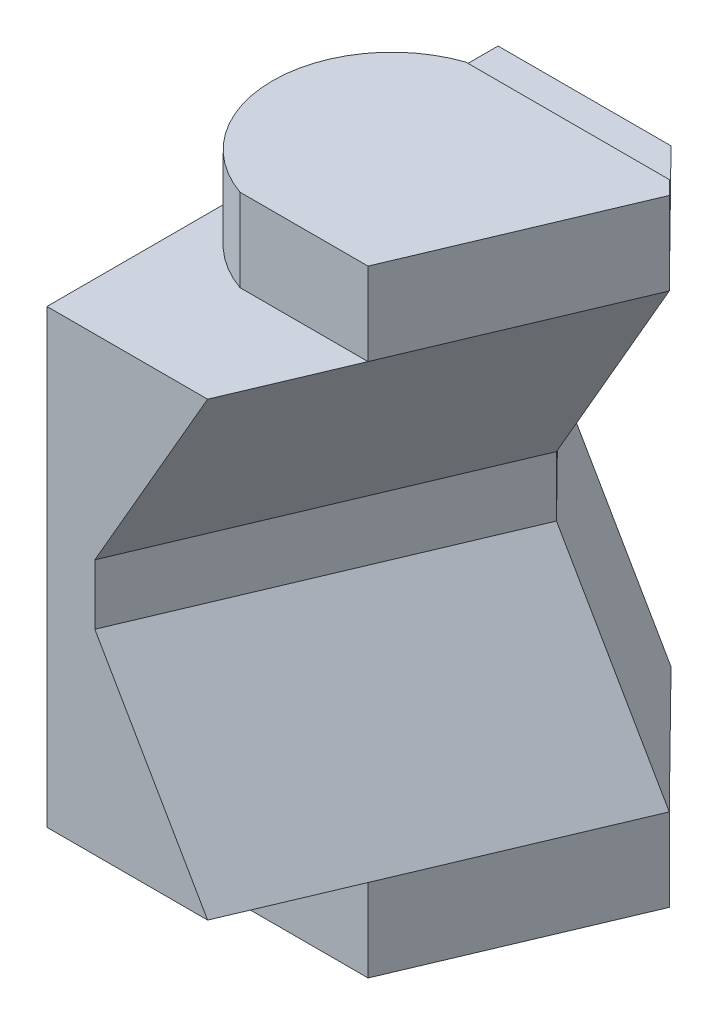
ISO-10303-21;
HEADER;
FILE_DESCRIPTION(('STEP AP214'),'2;1');
FILE_NAME('part.step','',(''),(''),'','','');
FILE_SCHEMA(('AUTOMOTIVE_DESIGN { 1 0 10303 214 1 1 1 1 }'));
ENDSEC;
DATA;
#1=APPLICATION_CONTEXT('core data for automotive mechanical design processes');
#2=APPLICATION_PROTOCOL_DEFINITION('international standard','automotive_design',2000,#1);
#3=PRODUCT_CONTEXT('',#1,'mechanical');
#4=PRODUCT('Part','Part','',(#3));
#5=PRODUCT_RELATED_PRODUCT_CATEGORY('part','',(#4));
#6=PRODUCT_DEFINITION_FORMATION('','',#4);
#7=PRODUCT_DEFINITION_CONTEXT('part definition',#1,'design');
#8=PRODUCT_DEFINITION('design','',#6,#7);
#9=PRODUCT_DEFINITION_SHAPE('','',#8);
#10=(LENGTH_UNIT() NAMED_UNIT(*) SI_UNIT(.MILLI.,.METRE.));
#11=(NAMED_UNIT(*) PLANE_ANGLE_UNIT() SI_UNIT($,.RADIAN.));
#12=(NAMED_UNIT(*) SI_UNIT($,.STERADIAN.) SOLID_ANGLE_UNIT());
#13=UNCERTAINTY_MEASURE_WITH_UNIT(LENGTH_MEASURE(1.E-05),#10,'distance_accuracy_value','');
#14=(GEOMETRIC_REPRESENTATION_CONTEXT(3) GLOBAL_UNCERTAINTY_ASSIGNED_CONTEXT((#13)) GLOBAL_UNIT_ASSIGNED_CONTEXT((#10,
#11,#12)) REPRESENTATION_CONTEXT('',''));
#15=CARTESIAN_POINT('',(0.,0.,0.));
#16=DIRECTION('',(0.,0.,1.));
#17=DIRECTION('',(1.,0.,0.));
#18=AXIS2_PLACEMENT_3D('',#15,#16,#17);
#19=CARTESIAN_POINT('',(7.9361055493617,22.,15.));
#20=DIRECTION('',(0.,-1.,0.));
#21=DIRECTION('',(0.,0.,-1.));
#22=AXIS2_PLACEMENT_3D('',#19,#20,#21);
#23=CYLINDRICAL_SURFACE('',#22,7.93610561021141);
#24=CARTESIAN_POINT('',(7.9361055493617,20.5,15.));
#25=DIRECTION('',(0.,1.,0.));
#26=DIRECTION('',(0.,0.,1.));
#27=AXIS2_PLACEMENT_3D('',#24,#25,#26);
#28=CIRCLE('',#27,7.93610561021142);
#29=CARTESIAN_POINT('',(5.34153964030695,20.5,7.5));
#30=VERTEX_POINT('',#29);
#31=CARTESIAN_POINT('',(5.34153964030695,20.5,22.5));
#32=VERTEX_POINT('',#31);
#33=EDGE_CURVE('E140',#30,#32,#28,.T.);
#34=ORIENTED_EDGE('',*,*,#33,.F.);
#35=DIRECTION('',(0.,-1.,0.));
#36=VECTOR('',#35,1.);
#37=CARTESIAN_POINT('',(5.34153964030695,22.,7.5));
#38=LINE('',#37,#36);
#39=CARTESIAN_POINT('',(5.34153964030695,15.,7.5));
#40=VERTEX_POINT('',#39);
#41=EDGE_CURVE('E170',#30,#40,#38,.T.);
#42=ORIENTED_EDGE('',*,*,#41,.T.);
#43=CARTESIAN_POINT('',(7.9361055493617,15.,15.));
#44=DIRECTION('',(0.,1.,0.));
#45=DIRECTION('',(0.,0.,-1.));
#46=AXIS2_PLACEMENT_3D('',#43,#44,#45);
#47=CIRCLE('',#46,7.93610561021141);
#48=CARTESIAN_POINT('',(0.,15.,15.));
#49=VERTEX_POINT('',#48);
#50=EDGE_CURVE('E270',#40,#49,#47,.T.);
#51=ORIENTED_EDGE('',*,*,#50,.T.);
#52=CARTESIAN_POINT('',(5.34153964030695,15.,22.5));
#53=VERTEX_POINT('',#52);
#54=EDGE_CURVE('E23',#49,#53,#47,.T.);
#55=ORIENTED_EDGE('',*,*,#54,.T.);
#56=DIRECTION('',(0.,-1.,0.));
#57=VECTOR('',#56,1.);
#58=CARTESIAN_POINT('',(5.34153964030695,22.,22.5));
#59=LINE('',#58,#57);
#60=EDGE_CURVE('E154',#32,#53,#59,.T.);
#61=ORIENTED_EDGE('',*,*,#60,.F.);
#62=EDGE_LOOP('',(#34,#42,#51,#55,#61));
#63=FACE_BOUND('',#62,.T.);
#64=ADVANCED_FACE('F14',(#63),#23,.T.);
#65=CARTESIAN_POINT('',(5.34153964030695,22.,22.5));
#66=DIRECTION('',(0.,0.,-1.));
#67=DIRECTION('',(1.,0.,0.));
#68=AXIS2_PLACEMENT_3D('',#65,#66,#67);
#69=PLANE('',#68);
#70=DIRECTION('',(1.,0.,0.));
#71=VECTOR('',#70,1.);
#72=CARTESIAN_POINT('',(5.34153964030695,20.5,22.5));
#73=LINE('',#72,#71);
#74=CARTESIAN_POINT('',(13.8512033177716,20.5,22.5));
#75=VERTEX_POINT('',#74);
#76=EDGE_CURVE('E143',#32,#75,#73,.T.);
#77=ORIENTED_EDGE('',*,*,#76,.F.);
#78=ORIENTED_EDGE('',*,*,#60,.T.);
#79=DIRECTION('',(1.,0.,0.));
#80=VECTOR('',#79,1.);
#81=CARTESIAN_POINT('',(5.34153964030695,15.,22.5));
#82=LINE('',#81,#80);
#83=CARTESIAN_POINT('',(13.8512033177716,15.,22.5));
#84=VERTEX_POINT('',#83);
#85=EDGE_CURVE('E266',#53,#84,#82,.T.);
#86=ORIENTED_EDGE('',*,*,#85,.T.);
#87=DIRECTION('',(0.,-1.,0.));
#88=VECTOR('',#87,1.);
#89=CARTESIAN_POINT('',(13.8512033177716,22.,22.5));
#90=LINE('',#89,#88);
#91=EDGE_CURVE('E156',#75,#84,#90,.T.);
#92=ORIENTED_EDGE('',*,*,#91,.F.);
#93=EDGE_LOOP('',(#77,#78,#86,#92));
#94=FACE_BOUND('',#93,.T.);
#95=ADVANCED_FACE('F152',(#94),#69,.F.);
#96=CARTESIAN_POINT('',(19.8001536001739,22.,8.41686228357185));
#97=DIRECTION('',(-0.921185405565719,0.,-0.389123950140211));
#98=DIRECTION('',(0.389123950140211,0.,-0.921185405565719));
#99=AXIS2_PLACEMENT_3D('',#96,#97,#98);
#100=PLANE('',#99);
#101=DIRECTION('',(0.389123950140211,0.,-0.921185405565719));
#102=VECTOR('',#101,1.);
#103=CARTESIAN_POINT('',(13.8512033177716,20.5,22.5));
#104=LINE('',#103,#102);
#105=CARTESIAN_POINT('',(19.8001536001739,20.5,8.41686228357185));
#106=VERTEX_POINT('',#105);
#107=EDGE_CURVE('E157',#75,#106,#104,.T.);
#108=ORIENTED_EDGE('',*,*,#107,.F.);
#109=ORIENTED_EDGE('',*,*,#91,.T.);
#110=DIRECTION('',(0.389123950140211,0.,-0.921185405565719));
#111=VECTOR('',#110,1.);
#112=CARTESIAN_POINT('',(10.6830792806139,15.,30.));
#113=LINE('',#112,#111);
#114=CARTESIAN_POINT('',(19.8001536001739,15.,8.41686228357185));
#115=VERTEX_POINT('',#114);
#116=EDGE_CURVE('E262',#115,#84,#113,.F.);
#117=ORIENTED_EDGE('',*,*,#116,.F.);
#118=DIRECTION('',(0.,-1.,0.));
#119=VECTOR('',#118,1.);
#120=CARTESIAN_POINT('',(19.8001536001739,22.,8.41686228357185));
#121=LINE('',#120,#119);
#122=EDGE_CURVE('E166',#106,#115,#121,.T.);
#123=ORIENTED_EDGE('',*,*,#122,.F.);
#124=EDGE_LOOP('',(#108,#109,#117,#123));
#125=FACE_BOUND('',#124,.T.);
#126=ADVANCED_FACE('F293',(#125),#100,.F.);
#127=CARTESIAN_POINT('',(18.8960045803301,22.,7.5));
#128=DIRECTION('',(-0.712026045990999,0.,0.70215305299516));
#129=DIRECTION('',(-0.70215305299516,0.,-0.712026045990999));
#130=AXIS2_PLACEMENT_3D('',#127,#128,#129);
#131=PLANE('',#130);
#132=DIRECTION('',(-0.702153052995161,0.,-0.712026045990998));
#133=VECTOR('',#132,1.);
#134=CARTESIAN_POINT('',(19.8001536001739,20.5,8.41686228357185));
#135=LINE('',#134,#133);
#136=CARTESIAN_POINT('',(18.8960045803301,20.5,7.5));
#137=VERTEX_POINT('',#136);
#138=EDGE_CURVE('E32',#106,#137,#135,.T.);
#139=ORIENTED_EDGE('',*,*,#138,.F.);
#140=ORIENTED_EDGE('',*,*,#122,.T.);
#141=DIRECTION('',(-0.70215305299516,0.,-0.712026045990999));
#142=VECTOR('',#141,1.);
#143=CARTESIAN_POINT('',(18.8960045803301,15.,7.5));
#144=LINE('',#143,#142);
#145=CARTESIAN_POINT('',(18.8960045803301,15.,7.5));
#146=VERTEX_POINT('',#145);
#147=EDGE_CURVE('E212',#115,#146,#144,.T.);
#148=ORIENTED_EDGE('',*,*,#147,.T.);
#149=DIRECTION('',(0.,-1.,0.));
#150=VECTOR('',#149,1.);
#151=CARTESIAN_POINT('',(18.8960045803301,22.,7.5));
#152=LINE('',#151,#150);
#153=EDGE_CURVE('E213',#137,#146,#152,.T.);
#154=ORIENTED_EDGE('',*,*,#153,.F.);
#155=EDGE_LOOP('',(#139,#140,#148,#154));
#156=FACE_BOUND('',#155,.T.);
#157=ADVANCED_FACE('F291',(#156),#131,.F.);
#158=CARTESIAN_POINT('',(5.34153964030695,22.,7.5));
#159=DIRECTION('',(0.,0.,1.));
#160=DIRECTION('',(0.,-1.,0.));
#161=AXIS2_PLACEMENT_3D('',#158,#159,#160);
#162=PLANE('',#161);
#163=DIRECTION('',(-1.,0.,0.));
#164=VECTOR('',#163,1.);
#165=CARTESIAN_POINT('',(18.8960045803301,20.5,7.5));
#166=LINE('',#165,#164);
#167=EDGE_CURVE('E145',#137,#30,#166,.T.);
#168=ORIENTED_EDGE('',*,*,#167,.F.);
#169=ORIENTED_EDGE('',*,*,#153,.T.);
#170=DIRECTION('',(-1.,0.,0.));
#171=VECTOR('',#170,1.);
#172=CARTESIAN_POINT('',(5.34153964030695,15.,7.5));
#173=LINE('',#172,#171);
#174=EDGE_CURVE('E209',#146,#40,#173,.T.);
#175=ORIENTED_EDGE('',*,*,#174,.T.);
#176=ORIENTED_EDGE('',*,*,#41,.F.);
#177=EDGE_LOOP('',(#168,#169,#175,#176));
#178=FACE_BOUND('',#177,.T.);
#179=ADVANCED_FACE('F325',(#178),#162,.F.);
#180=CARTESIAN_POINT('',(7.9361055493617,-22.,15.));
#181=DIRECTION('',(0.,1.,0.));
#182=DIRECTION('',(0.,0.,1.));
#183=AXIS2_PLACEMENT_3D('',#180,#181,#182);
#184=CYLINDRICAL_SURFACE('',#183,7.93610561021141);
#185=DIRECTION('',(0.,1.,0.));
#186=VECTOR('',#185,1.);
#187=CARTESIAN_POINT('',(5.34153964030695,-22.,7.5));
#188=LINE('',#187,#186);
#189=CARTESIAN_POINT('',(5.34153964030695,-20.5,7.5));
#190=VERTEX_POINT('',#189);
#191=CARTESIAN_POINT('',(5.34153964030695,-15.,7.5));
#192=VERTEX_POINT('',#191);
#193=EDGE_CURVE('E218',#190,#192,#188,.T.);
#194=ORIENTED_EDGE('',*,*,#193,.F.);
#195=CARTESIAN_POINT('',(7.9361055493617,-20.5,15.));
#196=DIRECTION('',(0.,-1.,0.));
#197=DIRECTION('',(0.,0.,-1.));
#198=AXIS2_PLACEMENT_3D('',#195,#196,#197);
#199=CIRCLE('',#198,7.93610561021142);
#200=CARTESIAN_POINT('',(5.34153964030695,-20.5,22.5));
#201=VERTEX_POINT('',#200);
#202=EDGE_CURVE('E285',#201,#190,#199,.T.);
#203=ORIENTED_EDGE('',*,*,#202,.F.);
#204=DIRECTION('',(0.,1.,0.));
#205=VECTOR('',#204,1.);
#206=CARTESIAN_POINT('',(5.34153964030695,-22.,22.5));
#207=LINE('',#206,#205);
#208=CARTESIAN_POINT('',(5.34153964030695,-15.,22.5));
#209=VERTEX_POINT('',#208);
#210=EDGE_CURVE('E226',#201,#209,#207,.T.);
#211=ORIENTED_EDGE('',*,*,#210,.T.);
#212=CARTESIAN_POINT('',(7.9361055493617,-15.,15.));
#213=DIRECTION('',(0.,1.,0.));
#214=DIRECTION('',(0.,0.,-1.));
#215=AXIS2_PLACEMENT_3D('',#212,#213,#214);
#216=CIRCLE('',#215,7.93610561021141);
#217=CARTESIAN_POINT('',(-6.08496968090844E-08,-15.,15.));
#218=VERTEX_POINT('',#217);
#219=EDGE_CURVE('E9',#218,#209,#216,.T.);
#220=ORIENTED_EDGE('',*,*,#219,.F.);
#221=EDGE_CURVE('E25',#192,#218,#216,.T.);
#222=ORIENTED_EDGE('',*,*,#221,.F.);
#223=EDGE_LOOP('',(#194,#203,#211,#220,#222));
#224=FACE_BOUND('',#223,.T.);
#225=ADVANCED_FACE('F327',(#224),#184,.T.);
#226=CARTESIAN_POINT('',(5.34153964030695,-22.,7.5));
#227=DIRECTION('',(0.,0.,-1.));
#228=DIRECTION('',(0.,1.,0.));
#229=AXIS2_PLACEMENT_3D('',#226,#227,#228);
#230=PLANE('',#229);
#231=DIRECTION('',(0.,1.,0.));
#232=VECTOR('',#231,1.);
#233=CARTESIAN_POINT('',(18.8960045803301,-22.,7.5));
#234=LINE('',#233,#232);
#235=CARTESIAN_POINT('',(18.8960045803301,-20.5,7.5));
#236=VERTEX_POINT('',#235);
#237=CARTESIAN_POINT('',(18.8960045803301,-15.,7.5));
#238=VERTEX_POINT('',#237);
#239=EDGE_CURVE('E216',#236,#238,#234,.T.);
#240=ORIENTED_EDGE('',*,*,#239,.F.);
#241=DIRECTION('',(1.,0.,0.));
#242=VECTOR('',#241,1.);
#243=CARTESIAN_POINT('',(5.34153964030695,-20.5,7.5));
#244=LINE('',#243,#242);
#245=EDGE_CURVE('E283',#190,#236,#244,.T.);
#246=ORIENTED_EDGE('',*,*,#245,.F.);
#247=ORIENTED_EDGE('',*,*,#193,.T.);
#248=DIRECTION('',(-1.,0.,0.));
#249=VECTOR('',#248,1.);
#250=CARTESIAN_POINT('',(5.34153964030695,-15.,7.5));
#251=LINE('',#250,#249);
#252=EDGE_CURVE('E220',#238,#192,#251,.T.);
#253=ORIENTED_EDGE('',*,*,#252,.F.);
#254=EDGE_LOOP('',(#240,#246,#247,#253));
#255=FACE_BOUND('',#254,.T.);
#256=ADVANCED_FACE('F335',(#255),#230,.T.);
#257=CARTESIAN_POINT('',(18.8960045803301,-22.,7.5));
#258=DIRECTION('',(0.712026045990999,0.,-0.70215305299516));
#259=DIRECTION('',(0.70215305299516,0.,0.712026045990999));
#260=AXIS2_PLACEMENT_3D('',#257,#258,#259);
#261=PLANE('',#260);
#262=DIRECTION('',(0.,1.,0.));
#263=VECTOR('',#262,1.);
#264=CARTESIAN_POINT('',(19.8001536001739,-22.,8.41686228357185));
#265=LINE('',#264,#263);
#266=CARTESIAN_POINT('',(19.8001536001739,-20.5,8.41686228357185));
#267=VERTEX_POINT('',#266);
#268=CARTESIAN_POINT('',(19.8001536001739,-15.,8.41686228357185));
#269=VERTEX_POINT('',#268);
#270=EDGE_CURVE('E219',#267,#269,#265,.T.);
#271=ORIENTED_EDGE('',*,*,#270,.F.);
#272=DIRECTION('',(0.702153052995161,0.,0.712026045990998));
#273=VECTOR('',#272,1.);
#274=CARTESIAN_POINT('',(18.8960045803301,-20.5,7.5));
#275=LINE('',#274,#273);
#276=EDGE_CURVE('E281',#236,#267,#275,.T.);
#277=ORIENTED_EDGE('',*,*,#276,.F.);
#278=ORIENTED_EDGE('',*,*,#239,.T.);
#279=DIRECTION('',(-0.70215305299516,0.,-0.712026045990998));
#280=VECTOR('',#279,1.);
#281=CARTESIAN_POINT('',(19.8001536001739,-15.,8.41686228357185));
#282=LINE('',#281,#280);
#283=EDGE_CURVE('E18',#269,#238,#282,.T.);
#284=ORIENTED_EDGE('',*,*,#283,.F.);
#285=EDGE_LOOP('',(#271,#277,#278,#284));
#286=FACE_BOUND('',#285,.T.);
#287=ADVANCED_FACE('F406',(#286),#261,.T.);
#288=CARTESIAN_POINT('',(19.8001536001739,-22.,8.41686228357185));
#289=DIRECTION('',(0.921185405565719,0.,0.389123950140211));
#290=DIRECTION('',(-0.389123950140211,0.,0.921185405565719));
#291=AXIS2_PLACEMENT_3D('',#288,#289,#290);
#292=PLANE('',#291);
#293=DIRECTION('',(0.,1.,0.));
#294=VECTOR('',#293,1.);
#295=CARTESIAN_POINT('',(13.8512033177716,-22.,22.5));
#296=LINE('',#295,#294);
#297=CARTESIAN_POINT('',(13.8512033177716,-20.5,22.5));
#298=VERTEX_POINT('',#297);
#299=CARTESIAN_POINT('',(13.8512033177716,-15.,22.5));
#300=VERTEX_POINT('',#299);
#301=EDGE_CURVE('E224',#298,#300,#296,.T.);
#302=ORIENTED_EDGE('',*,*,#301,.F.);
#303=DIRECTION('',(-0.389123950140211,0.,0.921185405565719));
#304=VECTOR('',#303,1.);
#305=CARTESIAN_POINT('',(19.8001536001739,-20.5,8.41686228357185));
#306=LINE('',#305,#304);
#307=EDGE_CURVE('E40',#267,#298,#306,.T.);
#308=ORIENTED_EDGE('',*,*,#307,.F.);
#309=ORIENTED_EDGE('',*,*,#270,.T.);
#310=DIRECTION('',(-0.389123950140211,0.,0.921185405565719));
#311=VECTOR('',#310,1.);
#312=CARTESIAN_POINT('',(19.8001536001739,-15.,8.41686228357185));
#313=LINE('',#312,#311);
#314=EDGE_CURVE('E241',#269,#300,#313,.T.);
#315=ORIENTED_EDGE('',*,*,#314,.T.);
#316=EDGE_LOOP('',(#302,#308,#309,#315));
#317=FACE_BOUND('',#316,.T.);
#318=ADVANCED_FACE('F411',(#317),#292,.T.);
#319=CARTESIAN_POINT('',(5.34153964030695,-22.,22.5));
#320=DIRECTION('',(0.,0.,1.));
#321=DIRECTION('',(-1.,0.,0.));
#322=AXIS2_PLACEMENT_3D('',#319,#320,#321);
#323=PLANE('',#322);
#324=ORIENTED_EDGE('',*,*,#210,.F.);
#325=DIRECTION('',(-1.,0.,0.));
#326=VECTOR('',#325,1.);
#327=CARTESIAN_POINT('',(13.8512033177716,-20.5,22.5));
#328=LINE('',#327,#326);
#329=EDGE_CURVE('E278',#298,#201,#328,.T.);
#330=ORIENTED_EDGE('',*,*,#329,.F.);
#331=ORIENTED_EDGE('',*,*,#301,.T.);
#332=DIRECTION('',(1.,0.,0.));
#333=VECTOR('',#332,1.);
#334=CARTESIAN_POINT('',(5.34153964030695,-15.,22.5));
#335=LINE('',#334,#333);
#336=EDGE_CURVE('E275',#209,#300,#335,.T.);
#337=ORIENTED_EDGE('',*,*,#336,.F.);
#338=EDGE_LOOP('',(#324,#330,#331,#337));
#339=FACE_BOUND('',#338,.T.);
#340=ADVANCED_FACE('F389',(#339),#323,.T.);
#341=CARTESIAN_POINT('',(19.8001536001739,-15.,8.41686228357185));
#342=DIRECTION('',(0.,-1.,0.));
#343=DIRECTION('',(0.,0.,-1.));
#344=AXIS2_PLACEMENT_3D('',#341,#342,#343);
#345=PLANE('',#344);
#346=ORIENTED_EDGE('',*,*,#219,.T.);
#347=ORIENTED_EDGE('',*,*,#336,.T.);
#348=DIRECTION('',(-0.389123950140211,0.,0.921185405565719));
#349=VECTOR('',#348,1.);
#350=CARTESIAN_POINT('',(19.8001536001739,-15.,8.41686228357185));
#351=LINE('',#350,#349);
#352=CARTESIAN_POINT('',(10.6830792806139,-15.,30.));
#353=VERTEX_POINT('',#352);
#354=EDGE_CURVE('E244',#300,#353,#351,.T.);
#355=ORIENTED_EDGE('',*,*,#354,.T.);
#356=DIRECTION('',(1.,0.,0.));
#357=VECTOR('',#356,1.);
#358=CARTESIAN_POINT('',(19.8001536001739,-15.,30.));
#359=LINE('',#358,#357);
#360=CARTESIAN_POINT('',(0.,-15.,30.));
#361=VERTEX_POINT('',#360);
#362=EDGE_CURVE('E238',#353,#361,#359,.F.);
#363=ORIENTED_EDGE('',*,*,#362,.T.);
#364=DIRECTION('',(0.,0.,-1.));
#365=VECTOR('',#364,1.);
#366=CARTESIAN_POINT('',(0.,-15.,8.41686228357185));
#367=LINE('',#366,#365);
#368=EDGE_CURVE('E233',#361,#218,#367,.T.);
#369=ORIENTED_EDGE('',*,*,#368,.T.);
#370=EDGE_LOOP('',(#346,#347,#355,#363,#369));
#371=FACE_BOUND('',#370,.T.);
#372=ADVANCED_FACE('F16',(#371),#345,.T.);
#373=ORIENTED_EDGE('',*,*,#252,.T.);
#374=ORIENTED_EDGE('',*,*,#221,.T.);
#375=DIRECTION('',(0.,0.,-1.));
#376=VECTOR('',#375,1.);
#377=CARTESIAN_POINT('',(0.,-15.,8.41686228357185));
#378=LINE('',#377,#376);
#379=CARTESIAN_POINT('',(0.,-15.,0.));
#380=VERTEX_POINT('',#379);
#381=EDGE_CURVE('E236',#218,#380,#378,.T.);
#382=ORIENTED_EDGE('',*,*,#381,.T.);
#383=DIRECTION('',(1.,0.,0.));
#384=VECTOR('',#383,1.);
#385=CARTESIAN_POINT('',(19.8001536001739,-15.,0.));
#386=LINE('',#385,#384);
#387=CARTESIAN_POINT('',(11.5,-15.,0.));
#388=VERTEX_POINT('',#387);
#389=EDGE_CURVE('E186',#380,#388,#386,.T.);
#390=ORIENTED_EDGE('',*,*,#389,.T.);
#391=DIRECTION('',(0.70215305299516,0.,0.712026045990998));
#392=VECTOR('',#391,1.);
#393=CARTESIAN_POINT('',(11.5,-15.,0.));
#394=LINE('',#393,#392);
#395=EDGE_CURVE('E201',#388,#238,#394,.T.);
#396=ORIENTED_EDGE('',*,*,#395,.T.);
#397=EDGE_LOOP('',(#373,#374,#382,#390,#396));
#398=FACE_BOUND('',#397,.T.);
#399=ADVANCED_FACE('F379',(#398),#345,.T.);
#400=CARTESIAN_POINT('',(19.8001536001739,15.,8.41686228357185));
#401=DIRECTION('',(0.,1.,0.));
#402=DIRECTION('',(0.,0.,-1.));
#403=AXIS2_PLACEMENT_3D('',#400,#401,#402);
#404=PLANE('',#403);
#405=ORIENTED_EDGE('',*,*,#174,.F.);
#406=DIRECTION('',(-0.70215305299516,0.,-0.712026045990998));
#407=VECTOR('',#406,1.);
#408=CARTESIAN_POINT('',(19.8001536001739,15.,8.41686228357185));
#409=LINE('',#408,#407);
#410=CARTESIAN_POINT('',(11.5,15.,0.));
#411=VERTEX_POINT('',#410);
#412=EDGE_CURVE('E161',#411,#146,#409,.F.);
#413=ORIENTED_EDGE('',*,*,#412,.F.);
#414=DIRECTION('',(1.,0.,0.));
#415=VECTOR('',#414,1.);
#416=CARTESIAN_POINT('',(11.5,15.,0.));
#417=LINE('',#416,#415);
#418=CARTESIAN_POINT('',(0.,15.,0.));
#419=VERTEX_POINT('',#418);
#420=EDGE_CURVE('E175',#419,#411,#417,.T.);
#421=ORIENTED_EDGE('',*,*,#420,.F.);
#422=DIRECTION('',(0.,0.,1.));
#423=VECTOR('',#422,1.);
#424=CARTESIAN_POINT('',(0.,15.,0.));
#425=LINE('',#424,#423);
#426=EDGE_CURVE('E257',#49,#419,#425,.F.);
#427=ORIENTED_EDGE('',*,*,#426,.F.);
#428=ORIENTED_EDGE('',*,*,#50,.F.);
#429=EDGE_LOOP('',(#405,#413,#421,#427,#428));
#430=FACE_BOUND('',#429,.T.);
#431=ADVANCED_FACE('F321',(#430),#404,.T.);
#432=CARTESIAN_POINT('',(3.18307928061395,-2.,30.));
#433=DIRECTION('',(-0.813444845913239,-0.469295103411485,-0.343612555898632));
#434=DIRECTION('',(0.499722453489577,-0.8661855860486,0.));
#435=AXIS2_PLACEMENT_3D('',#432,#433,#434);
#436=PLANE('',#435);
#437=DIRECTION('',(0.499722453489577,-0.8661855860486,0.));
#438=VECTOR('',#437,1.);
#439=CARTESIAN_POINT('',(3.18307928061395,-2.,30.));
#440=LINE('',#439,#438);
#441=CARTESIAN_POINT('',(3.18307928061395,-2.,30.));
#442=VERTEX_POINT('',#441);
#443=EDGE_CURVE('E191',#442,#353,#440,.T.);
#444=ORIENTED_EDGE('',*,*,#443,.T.);
#445=ORIENTED_EDGE('',*,*,#354,.F.);
#446=ORIENTED_EDGE('',*,*,#314,.F.);
#447=DIRECTION('',(0.499722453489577,-0.8661855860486,0.));
#448=VECTOR('',#447,1.);
#449=CARTESIAN_POINT('',(12.3001536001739,-2.,8.41686228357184));
#450=LINE('',#449,#448);
#451=CARTESIAN_POINT('',(12.3001536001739,-2.,8.41686228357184));
#452=VERTEX_POINT('',#451);
#453=EDGE_CURVE('E187',#452,#269,#450,.T.);
#454=ORIENTED_EDGE('',*,*,#453,.F.);
#455=DIRECTION('',(-0.389123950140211,0.,0.921185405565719));
#456=VECTOR('',#455,1.);
#457=CARTESIAN_POINT('',(12.3001536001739,-2.,8.41686228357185));
#458=LINE('',#457,#456);
#459=EDGE_CURVE('E190',#452,#442,#458,.T.);
#460=ORIENTED_EDGE('',*,*,#459,.T.);
#461=EDGE_LOOP('',(#444,#445,#446,#454,#460));
#462=FACE_BOUND('',#461,.T.);
#463=ADVANCED_FACE('F360',(#462),#436,.F.);
#464=CARTESIAN_POINT('',(19.8001536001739,-15.,8.41686228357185));
#465=DIRECTION('',(-0.658622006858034,-0.379974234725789,0.64948951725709));
#466=DIRECTION('',(-0.70215305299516,0.,-0.712026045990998));
#467=AXIS2_PLACEMENT_3D('',#464,#465,#466);
#468=PLANE('',#467);
#469=ORIENTED_EDGE('',*,*,#453,.T.);
#470=ORIENTED_EDGE('',*,*,#283,.T.);
#471=ORIENTED_EDGE('',*,*,#395,.F.);
#472=DIRECTION('',(0.499722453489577,-0.8661855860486,0.));
#473=VECTOR('',#472,1.);
#474=CARTESIAN_POINT('',(4.,-2.,0.));
#475=LINE('',#474,#473);
#476=CARTESIAN_POINT('',(4.,-2.,0.));
#477=VERTEX_POINT('',#476);
#478=EDGE_CURVE('E182',#477,#388,#475,.T.);
#479=ORIENTED_EDGE('',*,*,#478,.F.);
#480=DIRECTION('',(-0.70215305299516,0.,-0.712026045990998));
#481=VECTOR('',#480,1.);
#482=CARTESIAN_POINT('',(15.9977954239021,-2.,12.1664967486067));
#483=LINE('',#482,#481);
#484=EDGE_CURVE('E227',#477,#452,#483,.F.);
#485=ORIENTED_EDGE('',*,*,#484,.T.);
#486=EDGE_LOOP('',(#469,#470,#471,#479,#485));
#487=FACE_BOUND('',#486,.T.);
#488=ADVANCED_FACE('F363',(#487),#468,.F.);
#489=CARTESIAN_POINT('',(0.,-15.,30.));
#490=DIRECTION('',(0.,0.,-1.));
#491=DIRECTION('',(0.,1.,0.));
#492=AXIS2_PLACEMENT_3D('',#489,#490,#491);
#493=PLANE('',#492);
#494=DIRECTION('',(0.,-1.,0.));
#495=VECTOR('',#494,1.);
#496=CARTESIAN_POINT('',(0.,-2.,30.));
#497=LINE('',#496,#495);
#498=CARTESIAN_POINT('',(0.,15.,30.));
#499=VERTEX_POINT('',#498);
#500=EDGE_CURVE('E194',#499,#361,#497,.T.);
#501=ORIENTED_EDGE('',*,*,#500,.T.);
#502=ORIENTED_EDGE('',*,*,#362,.F.);
#503=ORIENTED_EDGE('',*,*,#443,.F.);
#504=DIRECTION('',(0.,-1.,0.));
#505=VECTOR('',#504,1.);
#506=CARTESIAN_POINT('',(3.18307928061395,0.,30.));
#507=LINE('',#506,#505);
#508=CARTESIAN_POINT('',(3.18307928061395,2.,30.));
#509=VERTEX_POINT('',#508);
#510=EDGE_CURVE('E199',#509,#442,#507,.T.);
#511=ORIENTED_EDGE('',*,*,#510,.F.);
#512=DIRECTION('',(0.499722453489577,0.8661855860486,0.));
#513=VECTOR('',#512,1.);
#514=CARTESIAN_POINT('',(3.18307928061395,2.,30.));
#515=LINE('',#514,#513);
#516=CARTESIAN_POINT('',(10.6830792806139,15.,30.));
#517=VERTEX_POINT('',#516);
#518=EDGE_CURVE('E174',#509,#517,#515,.T.);
#519=ORIENTED_EDGE('',*,*,#518,.T.);
#520=DIRECTION('',(1.,0.,0.));
#521=VECTOR('',#520,1.);
#522=CARTESIAN_POINT('',(0.,15.,30.));
#523=LINE('',#522,#521);
#524=EDGE_CURVE('E259',#517,#499,#523,.F.);
#525=ORIENTED_EDGE('',*,*,#524,.T.);
#526=EDGE_LOOP('',(#501,#502,#503,#511,#519,#525));
#527=FACE_BOUND('',#526,.T.);
#528=ADVANCED_FACE('F305',(#527),#493,.F.);
#529=CARTESIAN_POINT('',(0.,-2.,0.));
#530=DIRECTION('',(1.,0.,0.));
#531=DIRECTION('',(0.,0.,1.));
#532=AXIS2_PLACEMENT_3D('',#529,#530,#531);
#533=PLANE('',#532);
#534=DIRECTION('',(0.,-1.,0.));
#535=VECTOR('',#534,1.);
#536=CARTESIAN_POINT('',(0.,-2.,0.));
#537=LINE('',#536,#535);
#538=EDGE_CURVE('E185',#419,#380,#537,.T.);
#539=ORIENTED_EDGE('',*,*,#538,.T.);
#540=ORIENTED_EDGE('',*,*,#381,.F.);
#541=ORIENTED_EDGE('',*,*,#368,.F.);
#542=ORIENTED_EDGE('',*,*,#500,.F.);
#543=DIRECTION('',(0.,0.,1.));
#544=VECTOR('',#543,1.);
#545=CARTESIAN_POINT('',(0.,15.,0.));
#546=LINE('',#545,#544);
#547=EDGE_CURVE('E254',#499,#49,#546,.F.);
#548=ORIENTED_EDGE('',*,*,#547,.T.);
#549=ORIENTED_EDGE('',*,*,#426,.T.);
#550=EDGE_LOOP('',(#539,#540,#541,#542,#548,#549));
#551=FACE_BOUND('',#550,.T.);
#552=ADVANCED_FACE('F370',(#551),#533,.F.);
#553=CARTESIAN_POINT('',(11.5,-15.,0.));
#554=DIRECTION('',(0.,0.,1.));
#555=DIRECTION('',(0.,-1.,0.));
#556=AXIS2_PLACEMENT_3D('',#553,#554,#555);
#557=PLANE('',#556);
#558=ORIENTED_EDGE('',*,*,#478,.T.);
#559=ORIENTED_EDGE('',*,*,#389,.F.);
#560=ORIENTED_EDGE('',*,*,#538,.F.);
#561=ORIENTED_EDGE('',*,*,#420,.T.);
#562=DIRECTION('',(0.499722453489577,0.8661855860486,0.));
#563=VECTOR('',#562,1.);
#564=CARTESIAN_POINT('',(4.,2.,0.));
#565=LINE('',#564,#563);
#566=CARTESIAN_POINT('',(4.,2.,0.));
#567=VERTEX_POINT('',#566);
#568=EDGE_CURVE('E172',#567,#411,#565,.T.);
#569=ORIENTED_EDGE('',*,*,#568,.F.);
#570=DIRECTION('',(0.,-1.,0.));
#571=VECTOR('',#570,1.);
#572=CARTESIAN_POINT('',(4.,0.,0.));
#573=LINE('',#572,#571);
#574=EDGE_CURVE('E205',#567,#477,#573,.T.);
#575=ORIENTED_EDGE('',*,*,#574,.T.);
#576=EDGE_LOOP('',(#558,#559,#560,#561,#569,#575));
#577=FACE_BOUND('',#576,.T.);
#578=ADVANCED_FACE('F359',(#577),#557,.F.);
#579=CARTESIAN_POINT('',(3.18307928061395,0.,30.));
#580=DIRECTION('',(-0.921185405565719,0.,-0.389123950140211));
#581=DIRECTION('',(0.389123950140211,0.,-0.92118540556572));
#582=AXIS2_PLACEMENT_3D('',#579,#580,#581);
#583=PLANE('',#582);
#584=ORIENTED_EDGE('',*,*,#459,.F.);
#585=DIRECTION('',(0.,-1.,0.));
#586=VECTOR('',#585,1.);
#587=CARTESIAN_POINT('',(12.3001536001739,0.,8.41686228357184));
#588=LINE('',#587,#586);
#589=CARTESIAN_POINT('',(12.3001536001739,2.,8.41686228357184));
#590=VERTEX_POINT('',#589);
#591=EDGE_CURVE('E202',#590,#452,#588,.T.);
#592=ORIENTED_EDGE('',*,*,#591,.F.);
#593=DIRECTION('',(0.389123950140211,0.,-0.92118540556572));
#594=VECTOR('',#593,1.);
#595=CARTESIAN_POINT('',(3.18307928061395,2.,30.));
#596=LINE('',#595,#594);
#597=EDGE_CURVE('E179',#590,#509,#596,.F.);
#598=ORIENTED_EDGE('',*,*,#597,.T.);
#599=ORIENTED_EDGE('',*,*,#510,.T.);
#600=EDGE_LOOP('',(#584,#592,#598,#599));
#601=FACE_BOUND('',#600,.T.);
#602=ADVANCED_FACE('F309',(#601),#583,.F.);
#603=CARTESIAN_POINT('',(12.3001536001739,0.,8.41686228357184));
#604=DIRECTION('',(-0.712026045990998,0.,0.702153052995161));
#605=DIRECTION('',(-0.702153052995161,0.,-0.712026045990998));
#606=AXIS2_PLACEMENT_3D('',#603,#604,#605);
#607=PLANE('',#606);
#608=ORIENTED_EDGE('',*,*,#484,.F.);
#609=ORIENTED_EDGE('',*,*,#574,.F.);
#610=DIRECTION('',(-0.702153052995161,0.,-0.712026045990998));
#611=VECTOR('',#610,1.);
#612=CARTESIAN_POINT('',(12.3001536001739,2.,8.41686228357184));
#613=LINE('',#612,#611);
#614=EDGE_CURVE('E207',#567,#590,#613,.F.);
#615=ORIENTED_EDGE('',*,*,#614,.T.);
#616=ORIENTED_EDGE('',*,*,#591,.T.);
#617=EDGE_LOOP('',(#608,#609,#615,#616));
#618=FACE_BOUND('',#617,.T.);
#619=ADVANCED_FACE('F313',(#618),#607,.F.);
#620=ORIENTED_EDGE('',*,*,#54,.F.);
#621=ORIENTED_EDGE('',*,*,#547,.F.);
#622=ORIENTED_EDGE('',*,*,#524,.F.);
#623=DIRECTION('',(0.389123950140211,0.,-0.921185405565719));
#624=VECTOR('',#623,1.);
#625=CARTESIAN_POINT('',(10.6830792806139,15.,30.));
#626=LINE('',#625,#624);
#627=EDGE_CURVE('E164',#84,#517,#626,.F.);
#628=ORIENTED_EDGE('',*,*,#627,.F.);
#629=ORIENTED_EDGE('',*,*,#85,.F.);
#630=EDGE_LOOP('',(#620,#621,#622,#628,#629));
#631=FACE_BOUND('',#630,.T.);
#632=ADVANCED_FACE('F302',(#631),#404,.T.);
#633=CARTESIAN_POINT('',(3.18307928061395,2.,30.));
#634=DIRECTION('',(-0.813444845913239,0.469295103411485,-0.343612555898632));
#635=DIRECTION('',(0.499722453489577,0.8661855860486,0.));
#636=AXIS2_PLACEMENT_3D('',#633,#634,#635);
#637=PLANE('',#636);
#638=ORIENTED_EDGE('',*,*,#518,.F.);
#639=ORIENTED_EDGE('',*,*,#597,.F.);
#640=DIRECTION('',(0.499722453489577,0.8661855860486,0.));
#641=VECTOR('',#640,1.);
#642=CARTESIAN_POINT('',(12.3001536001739,2.,8.41686228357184));
#643=LINE('',#642,#641);
#644=EDGE_CURVE('E176',#590,#115,#643,.T.);
#645=ORIENTED_EDGE('',*,*,#644,.T.);
#646=ORIENTED_EDGE('',*,*,#116,.T.);
#647=ORIENTED_EDGE('',*,*,#627,.T.);
#648=EDGE_LOOP('',(#638,#639,#645,#646,#647));
#649=FACE_BOUND('',#648,.T.);
#650=ADVANCED_FACE('F297',(#649),#637,.F.);
#651=CARTESIAN_POINT('',(19.8001536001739,15.,8.41686228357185));
#652=DIRECTION('',(-0.658622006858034,0.379974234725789,0.64948951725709));
#653=DIRECTION('',(-0.70215305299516,0.,-0.712026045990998));
#654=AXIS2_PLACEMENT_3D('',#651,#652,#653);
#655=PLANE('',#654);
#656=ORIENTED_EDGE('',*,*,#644,.F.);
#657=ORIENTED_EDGE('',*,*,#614,.F.);
#658=ORIENTED_EDGE('',*,*,#568,.T.);
#659=ORIENTED_EDGE('',*,*,#412,.T.);
#660=ORIENTED_EDGE('',*,*,#147,.F.);
#661=EDGE_LOOP('',(#656,#657,#658,#659,#660));
#662=FACE_BOUND('',#661,.T.);
#663=ADVANCED_FACE('F316',(#662),#655,.F.);
#664=CARTESIAN_POINT('',(7.9361055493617,-20.5,15.));
#665=DIRECTION('',(0.,-1.,0.));
#666=DIRECTION('',(0.,0.,-1.));
#667=AXIS2_PLACEMENT_3D('',#664,#665,#666);
#668=PLANE('',#667);
#669=ORIENTED_EDGE('',*,*,#202,.T.);
#670=ORIENTED_EDGE('',*,*,#245,.T.);
#671=ORIENTED_EDGE('',*,*,#276,.T.);
#672=ORIENTED_EDGE('',*,*,#307,.T.);
#673=ORIENTED_EDGE('',*,*,#329,.T.);
#674=EDGE_LOOP('',(#669,#670,#671,#672,#673));
#675=FACE_BOUND('',#674,.T.);
#676=ADVANCED_FACE('F352',(#675),#668,.T.);
#677=CARTESIAN_POINT('',(7.9361055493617,20.5,15.));
#678=DIRECTION('',(0.,1.,0.));
#679=DIRECTION('',(0.,0.,1.));
#680=AXIS2_PLACEMENT_3D('',#677,#678,#679);
#681=PLANE('',#680);
#682=ORIENTED_EDGE('',*,*,#33,.T.);
#683=ORIENTED_EDGE('',*,*,#76,.T.);
#684=ORIENTED_EDGE('',*,*,#107,.T.);
#685=ORIENTED_EDGE('',*,*,#138,.T.);
#686=ORIENTED_EDGE('',*,*,#167,.T.);
#687=EDGE_LOOP('',(#682,#683,#684,#685,#686));
#688=FACE_BOUND('',#687,.T.);
#689=ADVANCED_FACE('F142',(#688),#681,.T.);
#690=CLOSED_SHELL('',(#64,#95,#126,#157,#179,#225,#256,#287,#318,#340,#372,#399,#431,#463,#488,
#528,#552,#578,#602,#619,#632,#650,#663,#676,#689));
#691=MANIFOLD_SOLID_BREP('B1',#690);
#692=ADVANCED_BREP_SHAPE_REPRESENTATION('',(#18,#691),#14);
#693=SHAPE_DEFINITION_REPRESENTATION(#9,#692);
ENDSEC;
END-ISO-10303-21;
